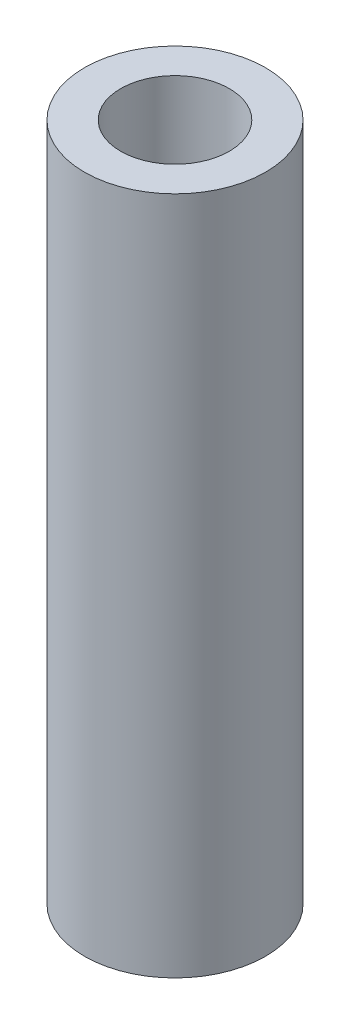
ISO-10303-21;
HEADER;
FILE_DESCRIPTION(('STEP AP214'),'2;1');
FILE_NAME('part.step','',(''),(''),'','','');
FILE_SCHEMA(('AUTOMOTIVE_DESIGN { 1 0 10303 214 1 1 1 1 }'));
ENDSEC;
DATA;
#1=APPLICATION_CONTEXT('core data for automotive mechanical design processes');
#2=APPLICATION_PROTOCOL_DEFINITION('international standard','automotive_design',2000,#1);
#3=PRODUCT_CONTEXT('',#1,'mechanical');
#4=PRODUCT('Part','Part','',(#3));
#5=PRODUCT_RELATED_PRODUCT_CATEGORY('part','',(#4));
#6=PRODUCT_DEFINITION_FORMATION('','',#4);
#7=PRODUCT_DEFINITION_CONTEXT('part definition',#1,'design');
#8=PRODUCT_DEFINITION('design','',#6,#7);
#9=PRODUCT_DEFINITION_SHAPE('','',#8);
#10=(LENGTH_UNIT() NAMED_UNIT(*) SI_UNIT(.MILLI.,.METRE.));
#11=(NAMED_UNIT(*) PLANE_ANGLE_UNIT() SI_UNIT($,.RADIAN.));
#12=(NAMED_UNIT(*) SI_UNIT($,.STERADIAN.) SOLID_ANGLE_UNIT());
#13=UNCERTAINTY_MEASURE_WITH_UNIT(LENGTH_MEASURE(1.E-05),#10,'distance_accuracy_value','');
#14=(GEOMETRIC_REPRESENTATION_CONTEXT(3) GLOBAL_UNCERTAINTY_ASSIGNED_CONTEXT((#13)) GLOBAL_UNIT_ASSIGNED_CONTEXT((#10,
#11,#12)) REPRESENTATION_CONTEXT('',''));
#15=CARTESIAN_POINT('',(0.,0.,0.));
#16=DIRECTION('',(0.,0.,1.));
#17=DIRECTION('',(1.,0.,0.));
#18=AXIS2_PLACEMENT_3D('',#15,#16,#17);
#19=CARTESIAN_POINT('',(0.,15.24,0.));
#20=DIRECTION('',(0.,-1.,0.));
#21=DIRECTION('',(0.,0.,-1.));
#22=AXIS2_PLACEMENT_3D('',#19,#20,#21);
#23=CYLINDRICAL_SURFACE('',#22,2.032);
#24=CARTESIAN_POINT('',(0.,15.24,0.));
#25=DIRECTION('',(0.,1.,0.));
#26=DIRECTION('',(0.,0.,1.));
#27=AXIS2_PLACEMENT_3D('',#24,#25,#26);
#28=CIRCLE('',#27,2.032);
#29=CARTESIAN_POINT('',(0.,15.24,-2.032));
#30=VERTEX_POINT('',#29);
#31=EDGE_CURVE('E10',#30,#30,#28,.T.);
#32=CARTESIAN_POINT('',(0.,0.,0.));
#33=DIRECTION('',(0.,1.,0.));
#34=DIRECTION('',(0.,0.,1.));
#35=AXIS2_PLACEMENT_3D('',#32,#33,#34);
#36=CIRCLE('',#35,2.032);
#37=CARTESIAN_POINT('',(0.,0.,-2.032));
#38=VERTEX_POINT('',#37);
#39=EDGE_CURVE('E36',#38,#38,#36,.T.);
#40=CARTESIAN_POINT('',(0.,15.24,-2.032));
#41=CARTESIAN_POINT('',(0.,15.08125,-2.032));
#42=CARTESIAN_POINT('',(0.,14.9225,-2.032));
#43=CARTESIAN_POINT('',(0.,14.605,-2.032));
#44=CARTESIAN_POINT('',(0.,14.44625,-2.032));
#45=CARTESIAN_POINT('',(0.,14.12875,-2.032));
#46=CARTESIAN_POINT('',(0.,13.97,-2.032));
#47=CARTESIAN_POINT('',(0.,13.6525,-2.032));
#48=CARTESIAN_POINT('',(0.,13.49375,-2.032));
#49=CARTESIAN_POINT('',(0.,13.17625,-2.032));
#50=CARTESIAN_POINT('',(0.,13.0175,-2.032));
#51=CARTESIAN_POINT('',(0.,12.7,-2.032));
#52=CARTESIAN_POINT('',(0.,12.54125,-2.032));
#53=CARTESIAN_POINT('',(0.,12.22375,-2.032));
#54=CARTESIAN_POINT('',(0.,12.065,-2.032));
#55=CARTESIAN_POINT('',(0.,11.7475,-2.032));
#56=CARTESIAN_POINT('',(0.,11.58875,-2.032));
#57=CARTESIAN_POINT('',(0.,11.27125,-2.032));
#58=CARTESIAN_POINT('',(0.,11.1125,-2.032));
#59=CARTESIAN_POINT('',(0.,10.795,-2.032));
#60=CARTESIAN_POINT('',(0.,10.63625,-2.032));
#61=CARTESIAN_POINT('',(0.,10.31875,-2.032));
#62=CARTESIAN_POINT('',(0.,10.16,-2.032));
#63=CARTESIAN_POINT('',(0.,9.8425,-2.032));
#64=CARTESIAN_POINT('',(0.,9.68375,-2.032));
#65=CARTESIAN_POINT('',(0.,9.36625,-2.032));
#66=CARTESIAN_POINT('',(0.,9.2075,-2.032));
#67=CARTESIAN_POINT('',(0.,8.89,-2.032));
#68=CARTESIAN_POINT('',(0.,8.73125,-2.032));
#69=CARTESIAN_POINT('',(0.,8.41375,-2.032));
#70=CARTESIAN_POINT('',(0.,8.255,-2.032));
#71=CARTESIAN_POINT('',(0.,7.9375,-2.032));
#72=CARTESIAN_POINT('',(0.,7.77875,-2.032));
#73=CARTESIAN_POINT('',(0.,7.46125,-2.032));
#74=CARTESIAN_POINT('',(0.,7.3025,-2.032));
#75=CARTESIAN_POINT('',(0.,6.985,-2.032));
#76=CARTESIAN_POINT('',(0.,6.82625,-2.032));
#77=CARTESIAN_POINT('',(0.,6.50875,-2.032));
#78=CARTESIAN_POINT('',(0.,6.35,-2.032));
#79=CARTESIAN_POINT('',(0.,6.0325,-2.032));
#80=CARTESIAN_POINT('',(0.,5.87375,-2.032));
#81=CARTESIAN_POINT('',(0.,5.55625,-2.032));
#82=CARTESIAN_POINT('',(0.,5.3975,-2.032));
#83=CARTESIAN_POINT('',(0.,5.08,-2.032));
#84=CARTESIAN_POINT('',(0.,4.92125,-2.032));
#85=CARTESIAN_POINT('',(0.,4.60375,-2.032));
#86=CARTESIAN_POINT('',(0.,4.445,-2.032));
#87=CARTESIAN_POINT('',(0.,4.1275,-2.032));
#88=CARTESIAN_POINT('',(0.,3.96875,-2.032));
#89=CARTESIAN_POINT('',(0.,3.65125,-2.032));
#90=CARTESIAN_POINT('',(0.,3.4925,-2.032));
#91=CARTESIAN_POINT('',(0.,3.175,-2.032));
#92=CARTESIAN_POINT('',(0.,3.01625,-2.032));
#93=CARTESIAN_POINT('',(0.,2.69875,-2.032));
#94=CARTESIAN_POINT('',(0.,2.54,-2.032));
#95=CARTESIAN_POINT('',(0.,2.2225,-2.032));
#96=CARTESIAN_POINT('',(0.,2.06375,-2.032));
#97=CARTESIAN_POINT('',(0.,1.74625,-2.032));
#98=CARTESIAN_POINT('',(0.,1.5875,-2.032));
#99=CARTESIAN_POINT('',(0.,1.27,-2.032));
#100=CARTESIAN_POINT('',(0.,1.11125,-2.032));
#101=CARTESIAN_POINT('',(0.,0.79375,-2.032));
#102=CARTESIAN_POINT('',(0.,0.634999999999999,-2.032));
#103=CARTESIAN_POINT('',(0.,0.3175,-2.032));
#104=CARTESIAN_POINT('',(0.,0.15875,-2.032));
#105=CARTESIAN_POINT('',(0.,0.,-2.032));
#106=B_SPLINE_CURVE_WITH_KNOTS('',3,(#40,#41,#42,#43,#44,#45,#46,#47,#48,#49,#50,#51,#52,#53,
#54,#55,#56,#57,#58,#59,#60,#61,#62,#63,#64,#65,#66,#67,#68,#69,#70,#71,#72,#73,#74,#75,#76,#77,
#78,#79,#80,#81,#82,#83,#84,#85,#86,#87,#88,#89,#90,#91,#92,#93,#94,#95,#96,#97,#98,#99,#100,
#101,#102,#103,#104,#105),.UNSPECIFIED.,.F.,.F.,(4,2,2,2,2,2,2,2,2,2,2,2,2,2,2,2,2,2,2,2,2,2,2,
2,2,2,2,2,2,2,2,2,4),(0.,0.476249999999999,0.952499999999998,1.42875,1.905,2.38125,2.8575,
3.33375,3.81,4.28625,4.7625,5.23875,5.715,6.19125,6.6675,7.14375,7.62,8.09625,8.5725,9.04875,
9.525,10.00125,10.4775,10.95375,11.43,11.90625,12.3825,12.85875,13.335,13.81125,14.2875,
14.76375,15.24),.UNSPECIFIED.);
#107=EDGE_CURVE('BSEAM33',#30,#38,#106,.T.);
#108=ORIENTED_EDGE('',*,*,#31,.F.);
#109=ORIENTED_EDGE('',*,*,#39,.T.);
#110=ORIENTED_EDGE('',*,*,#107,.T.);
#111=ORIENTED_EDGE('',*,*,#107,.F.);
#112=EDGE_LOOP('',(#108,#110,#109,#111));
#113=FACE_BOUND('',#112,.T.);
#114=ADVANCED_FACE('F33',(#113),#23,.T.);
#115=CARTESIAN_POINT('',(0.,15.24,0.));
#116=DIRECTION('',(0.,1.,0.));
#117=DIRECTION('',(0.,0.,1.));
#118=AXIS2_PLACEMENT_3D('',#115,#116,#117);
#119=PLANE('',#118);
#120=CARTESIAN_POINT('',(0.,15.24,0.));
#121=DIRECTION('',(0.,1.,0.));
#122=DIRECTION('',(0.,0.,1.));
#123=AXIS2_PLACEMENT_3D('',#120,#121,#122);
#124=CIRCLE('',#123,1.2192);
#125=CARTESIAN_POINT('',(0.,15.24,1.2192));
#126=VERTEX_POINT('',#125);
#127=EDGE_CURVE('E47',#126,#126,#124,.T.);
#128=ORIENTED_EDGE('',*,*,#127,.F.);
#129=EDGE_LOOP('',(#128));
#130=FACE_BOUND('',#129,.T.);
#131=ORIENTED_EDGE('',*,*,#31,.T.);
#132=EDGE_LOOP('',(#131));
#133=FACE_BOUND('',#132,.T.);
#134=ADVANCED_FACE('F53',(#130,#133),#119,.T.);
#135=CARTESIAN_POINT('',(0.,0.,0.));
#136=DIRECTION('',(0.,1.,0.));
#137=DIRECTION('',(0.,0.,1.));
#138=AXIS2_PLACEMENT_3D('',#135,#136,#137);
#139=PLANE('',#138);
#140=CARTESIAN_POINT('',(0.,0.,0.));
#141=DIRECTION('',(0.,1.,0.));
#142=DIRECTION('',(0.,0.,1.));
#143=AXIS2_PLACEMENT_3D('',#140,#141,#142);
#144=CIRCLE('',#143,1.2192);
#145=CARTESIAN_POINT('',(0.,0.,1.2192));
#146=VERTEX_POINT('',#145);
#147=EDGE_CURVE('E43',#146,#146,#144,.T.);
#148=ORIENTED_EDGE('',*,*,#147,.T.);
#149=EDGE_LOOP('',(#148));
#150=FACE_BOUND('',#149,.T.);
#151=ORIENTED_EDGE('',*,*,#39,.F.);
#152=EDGE_LOOP('',(#151));
#153=FACE_BOUND('',#152,.T.);
#154=ADVANCED_FACE('F55',(#150,#153),#139,.F.);
#155=CARTESIAN_POINT('',(0.,15.24,0.));
#156=DIRECTION('',(0.,1.,0.));
#157=DIRECTION('',(0.,0.,1.));
#158=AXIS2_PLACEMENT_3D('',#155,#156,#157);
#159=CYLINDRICAL_SURFACE('',#158,1.2192);
#160=ORIENTED_EDGE('',*,*,#147,.F.);
#161=EDGE_LOOP('',(#160));
#162=FACE_BOUND('',#161,.T.);
#163=ORIENTED_EDGE('',*,*,#127,.T.);
#164=EDGE_LOOP('',(#163));
#165=FACE_BOUND('',#164,.T.);
#166=ADVANCED_FACE('F51',(#162,#165),#159,.F.);
#167=CLOSED_SHELL('',(#114,#134,#154,#166));
#168=MANIFOLD_SOLID_BREP('B2',#167);
#169=ADVANCED_BREP_SHAPE_REPRESENTATION('',(#18,#168),#14);
#170=SHAPE_DEFINITION_REPRESENTATION(#9,#169);
ENDSEC;
END-ISO-10303-21;
